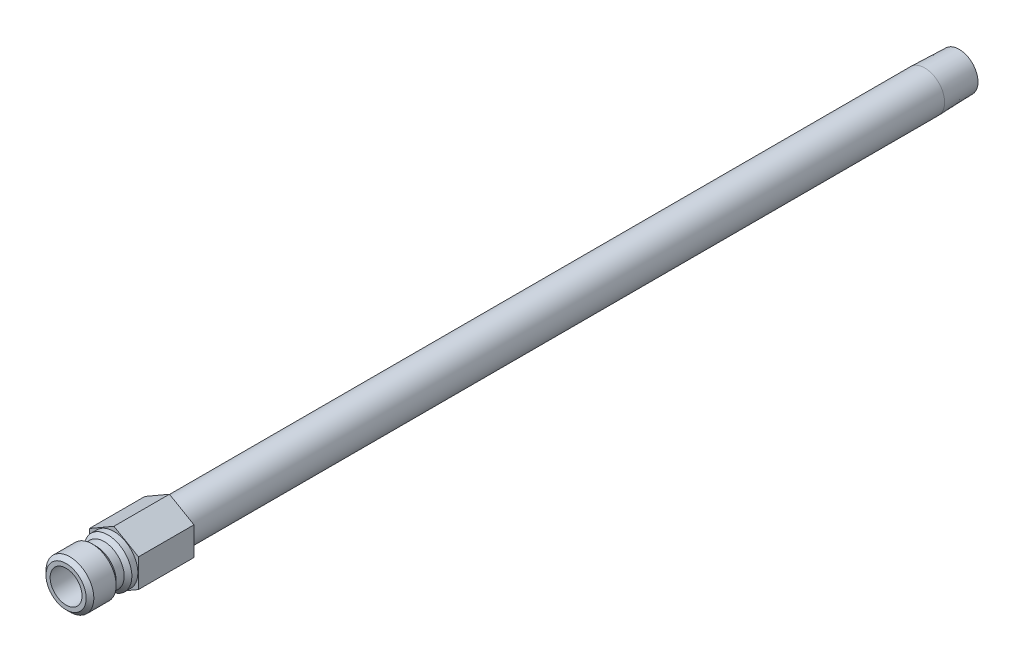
from build123d import *

# Parameters (mm, degrees)
SKETCH2_R           = 2.38125
BOSS_EXTRUDE1_DEPTH = 11.049


with BuildPart() as part:
    # Sketch1 → Revolve1 (revolve)
    with BuildSketch(Plane(origin=(0, 0, 0), x_dir=(0, 0, -1), z_dir=(1, 0, 0))):
        Polygon((-9.525, 3.175), (-9.525, 4.0005), (-8.763, 4.7625), (-4.318, 4.7625), (-3.556, 4.0005), (-1.9558, 4.0005), (-1.1938, 4.7625), (0, 4.7625), (0, 3.96875), (161.417, 3.96875), (168.275, 3.754438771), (168.275, 2.38125), (0.127, 2.38125), (0.127, 3.175), align=None)
    revolve(axis=Axis((0, 0, 0), (0, 0, 1)))

    # Sketch2 → Boss-Extrude1 (add)
    with BuildSketch(Plane.XY):
        Polygon((-4.8895, 2.822954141), (-4.8895, -2.822954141), (0, -5.645908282), (4.8895, -2.822954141), (4.8895, 2.822954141), (0, 5.645908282), align=None)
        with Locations(Location((0, 0, 0), (0, 0, 90))):
            Circle(SKETCH2_R, mode=Mode.SUBTRACT)
    extrude(amount=-BOSS_EXTRUDE1_DEPTH)


solid = part.part
